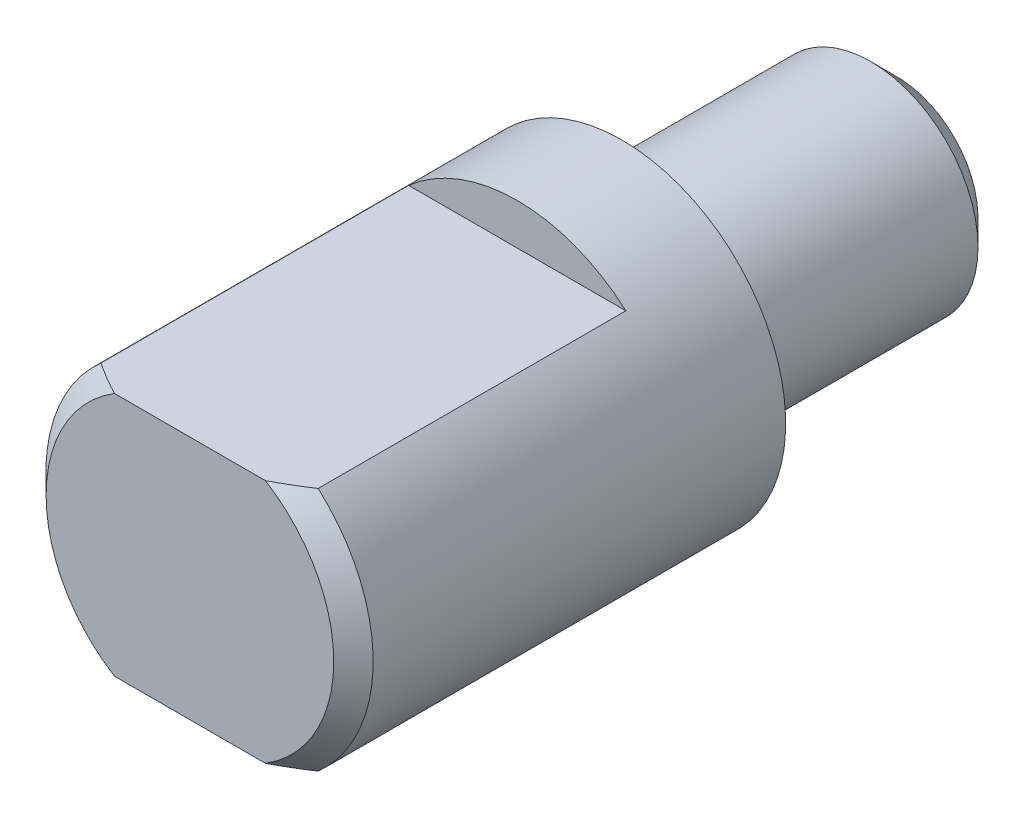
ISO-10303-21;
HEADER;
FILE_DESCRIPTION(('STEP AP214'),'2;1');
FILE_NAME('part.step','',(''),(''),'','','');
FILE_SCHEMA(('AUTOMOTIVE_DESIGN { 1 0 10303 214 1 1 1 1 }'));
ENDSEC;
DATA;
#1=APPLICATION_CONTEXT('core data for automotive mechanical design processes');
#2=APPLICATION_PROTOCOL_DEFINITION('international standard','automotive_design',2000,#1);
#3=PRODUCT_CONTEXT('',#1,'mechanical');
#4=PRODUCT('Part','Part','',(#3));
#5=PRODUCT_RELATED_PRODUCT_CATEGORY('part','',(#4));
#6=PRODUCT_DEFINITION_FORMATION('','',#4);
#7=PRODUCT_DEFINITION_CONTEXT('part definition',#1,'design');
#8=PRODUCT_DEFINITION('design','',#6,#7);
#9=PRODUCT_DEFINITION_SHAPE('','',#8);
#10=(LENGTH_UNIT() NAMED_UNIT(*) SI_UNIT(.MILLI.,.METRE.));
#11=(NAMED_UNIT(*) PLANE_ANGLE_UNIT() SI_UNIT($,.RADIAN.));
#12=(NAMED_UNIT(*) SI_UNIT($,.STERADIAN.) SOLID_ANGLE_UNIT());
#13=UNCERTAINTY_MEASURE_WITH_UNIT(LENGTH_MEASURE(1.E-05),#10,'distance_accuracy_value','');
#14=(GEOMETRIC_REPRESENTATION_CONTEXT(3) GLOBAL_UNCERTAINTY_ASSIGNED_CONTEXT((#13)) GLOBAL_UNIT_ASSIGNED_CONTEXT((#10,
#11,#12)) REPRESENTATION_CONTEXT('',''));
#15=CARTESIAN_POINT('',(0.,0.,0.));
#16=DIRECTION('',(0.,0.,1.));
#17=DIRECTION('',(1.,0.,0.));
#18=AXIS2_PLACEMENT_3D('',#15,#16,#17);
#19=CARTESIAN_POINT('',(0.,0.,3.684));
#20=DIRECTION('',(0.,0.,-1.));
#21=DIRECTION('',(0.,1.,0.));
#22=AXIS2_PLACEMENT_3D('',#19,#20,#21);
#23=CONICAL_SURFACE('',#22,3.175,0.79193401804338);
#24=CARTESIAN_POINT('',(0.,0.,3.684));
#25=DIRECTION('',(0.,0.,1.));
#26=DIRECTION('',(0.,-1.,0.));
#27=AXIS2_PLACEMENT_3D('',#24,#25,#26);
#28=CIRCLE('',#27,3.175);
#29=CARTESIAN_POINT('',(-2.10713075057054,2.375,3.684));
#30=VERTEX_POINT('',#29);
#31=CARTESIAN_POINT('',(-2.10713075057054,-2.375,3.684));
#32=VERTEX_POINT('',#31);
#33=EDGE_CURVE('E104',#30,#32,#28,.T.);
#34=ORIENTED_EDGE('',*,*,#33,.T.);
#35=CARTESIAN_POINT('',(-6.62966945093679,-2.375,-0.133015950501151));
#36=CARTESIAN_POINT('',(-6.41872085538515,-2.375,0.0629362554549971));
#37=CARTESIAN_POINT('',(-6.20729327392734,-2.375,0.258380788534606));
#38=CARTESIAN_POINT('',(-5.78286017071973,-2.375,0.647887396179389));
#39=CARTESIAN_POINT('',(-5.56985352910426,-2.375,0.841948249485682));
#40=CARTESIAN_POINT('',(-5.13574053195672,-2.375,1.23363349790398));
#41=CARTESIAN_POINT('',(-4.9145790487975,-2.375,1.43119690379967));
#42=CARTESIAN_POINT('',(-4.46963283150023,-2.375,1.82304516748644));
#43=CARTESIAN_POINT('',(-4.24585006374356,-2.375,2.01733224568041));
#44=CARTESIAN_POINT('',(-3.90719638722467,-2.375,2.30510248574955));
#45=CARTESIAN_POINT('',(-3.79385459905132,-2.375,2.40038380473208));
#46=CARTESIAN_POINT('',(-3.56590809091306,-2.375,2.58942155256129));
#47=CARTESIAN_POINT('',(-3.4513034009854,-2.375,2.68317801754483));
#48=CARTESIAN_POINT('',(-3.22025369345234,-2.375,2.86895465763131));
#49=CARTESIAN_POINT('',(-3.10380502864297,-2.375,2.96097030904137));
#50=CARTESIAN_POINT('',(-2.8689222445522,-2.375,3.14241965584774));
#51=CARTESIAN_POINT('',(-2.75048831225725,-2.375,3.23185359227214));
#52=CARTESIAN_POINT('',(-2.51255729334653,-2.375,3.40617108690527));
#53=CARTESIAN_POINT('',(-2.3930916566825,-2.375,3.49109735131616));
#54=CARTESIAN_POINT('',(-2.1509050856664,-2.375,3.65634247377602));
#55=CARTESIAN_POINT('',(-2.02818269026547,-2.375,3.73665921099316));
#56=CARTESIAN_POINT('',(-1.77912466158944,-2.375,3.89039659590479));
#57=CARTESIAN_POINT('',(-1.65280524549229,-2.375,3.96384327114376));
#58=CARTESIAN_POINT('',(-1.39512518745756,-2.375,4.10119391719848));
#59=CARTESIAN_POINT('',(-1.26377071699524,-2.375,4.16510912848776));
#60=CARTESIAN_POINT('',(-1.05701971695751,-2.375,4.25273595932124));
#61=CARTESIAN_POINT('',(-0.983728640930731,-2.375,4.28140199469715));
#62=CARTESIAN_POINT('',(-0.835356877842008,-2.375,4.33377721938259));
#63=CARTESIAN_POINT('',(-0.760275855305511,-2.375,4.35748547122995));
#64=CARTESIAN_POINT('',(-0.608898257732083,-2.375,4.39885359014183));
#65=CARTESIAN_POINT('',(-0.532610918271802,-2.375,4.41654679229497));
#66=CARTESIAN_POINT('',(-0.378780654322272,-2.375,4.445154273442));
#67=CARTESIAN_POINT('',(-0.301238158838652,-2.375,4.45607082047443));
#68=CARTESIAN_POINT('',(-0.144559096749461,-2.375,4.47054748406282));
#69=CARTESIAN_POINT('',(-0.0654144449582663,-2.375,4.47402190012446));
#70=CARTESIAN_POINT('',(0.0928249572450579,-2.375,4.47312081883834));
#71=CARTESIAN_POINT('',(0.171919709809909,-2.375,4.4687456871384));
#72=CARTESIAN_POINT('',(0.329626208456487,-2.375,4.45241265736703));
#73=CARTESIAN_POINT('',(0.40823478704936,-2.375,4.44042470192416));
#74=CARTESIAN_POINT('',(0.564086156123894,-2.375,4.40957980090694));
#75=CARTESIAN_POINT('',(0.641328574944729,-2.375,4.39072101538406));
#76=CARTESIAN_POINT('',(0.827865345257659,-2.375,4.33746225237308));
#77=CARTESIAN_POINT('',(0.936246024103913,-2.375,4.29987709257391));
#78=CARTESIAN_POINT('',(1.14927492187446,-2.375,4.21535984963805));
#79=CARTESIAN_POINT('',(1.25392057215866,-2.375,4.16842147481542));
#80=CARTESIAN_POINT('',(1.46087103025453,-2.375,4.06709514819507));
#81=CARTESIAN_POINT('',(1.56313950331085,-2.375,4.01263383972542));
#82=CARTESIAN_POINT('',(1.71427099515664,-2.375,3.9270384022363));
#83=CARTESIAN_POINT('',(1.76426245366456,-2.375,3.89786057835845));
#84=CARTESIAN_POINT('',(1.86356372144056,-2.375,3.83837009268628));
#85=CARTESIAN_POINT('',(1.91287355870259,-2.375,3.80805747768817));
#86=CARTESIAN_POINT('',(2.07522042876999,-2.375,3.70601224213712));
#87=CARTESIAN_POINT('',(2.18692206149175,-2.375,3.63215349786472));
#88=CARTESIAN_POINT('',(2.40772318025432,-2.375,3.48062951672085));
#89=CARTESIAN_POINT('',(2.5168220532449,-2.375,3.4029633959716));
#90=CARTESIAN_POINT('',(2.73301390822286,-2.375,3.24473477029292));
#91=CARTESIAN_POINT('',(2.84010537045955,-2.375,3.16417019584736));
#92=CARTESIAN_POINT('',(3.05261723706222,-2.375,3.00086187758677));
#93=CARTESIAN_POINT('',(3.15803753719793,-2.375,2.9181179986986));
#94=CARTESIAN_POINT('',(3.47300086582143,-2.375,2.6667998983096));
#95=CARTESIAN_POINT('',(3.68051445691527,-2.375,2.49568568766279));
#96=CARTESIAN_POINT('',(4.09182405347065,-2.375,2.14926116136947));
#97=CARTESIAN_POINT('',(4.29562161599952,-2.375,1.97395267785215));
#98=CARTESIAN_POINT('',(4.6793123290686,-2.375,1.63905531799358));
#99=CARTESIAN_POINT('',(4.85946034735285,-2.375,1.47975783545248));
#100=CARTESIAN_POINT('',(5.2182458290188,-2.375,1.15942835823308));
#101=CARTESIAN_POINT('',(5.39688309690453,-2.375,0.998396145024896));
#102=CARTESIAN_POINT('',(5.75173692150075,-2.375,0.67617475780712));
#103=CARTESIAN_POINT('',(5.92796166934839,-2.375,0.514994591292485));
#104=CARTESIAN_POINT('',(6.27946145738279,-2.375,0.191659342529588));
#105=CARTESIAN_POINT('',(6.45473664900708,-2.375,0.0295044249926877));
#106=CARTESIAN_POINT('',(6.62966945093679,-2.375,-0.133015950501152));
#107=B_SPLINE_CURVE_WITH_KNOTS('',3,(#35,#36,#37,#38,#39,#40,#41,#42,#43,#44,#45,#46,#47,#48,
#49,#50,#51,#52,#53,#54,#55,#56,#57,#58,#59,#60,#61,#62,#63,#64,#65,#66,#67,#68,#69,#70,#71,#72,
#73,#74,#75,#76,#77,#78,#79,#80,#81,#82,#83,#84,#85,#86,#87,#88,#89,#90,#91,#92,#93,#94,#95,#96,
#97,#98,#99,#100,#101,#102,#103,#104,#105,#106),.UNSPECIFIED.,.F.,.F.,(4,2,2,2,2,2,2,2,2,2,2,2,
2,2,2,2,2,2,2,2,2,2,2,2,2,2,2,2,2,2,2,2,2,2,2,4),(0.,0.863760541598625,1.72820709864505,
2.61784876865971,3.50686109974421,3.95106286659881,4.39525409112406,4.84047397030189,
5.28565214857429,5.72530383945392,6.16515621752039,6.60326828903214,7.04085953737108,
7.27681206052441,7.5128091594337,7.74747620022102,7.98206465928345,8.21934033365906,
8.45660495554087,8.69481223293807,8.93308334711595,9.27660606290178,9.6203606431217,
9.9677411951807,10.141380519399,10.3150126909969,10.7166254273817,11.1183318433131,
11.5203310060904,11.9223551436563,12.7291420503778,13.5355827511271,14.2569976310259,
14.9785044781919,15.6949553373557,16.4112883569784),.UNSPECIFIED.);
#108=CARTESIAN_POINT('',(-1.46406113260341,-2.375,4.064));
#109=VERTEX_POINT('',#108);
#110=EDGE_CURVE('E127',#32,#109,#107,.T.);
#111=ORIENTED_EDGE('',*,*,#110,.T.);
#112=CARTESIAN_POINT('',(0.,0.,4.064));
#113=DIRECTION('',(0.,0.,1.));
#114=DIRECTION('',(0.,-1.,0.));
#115=AXIS2_PLACEMENT_3D('',#112,#113,#114);
#116=CIRCLE('',#115,2.79);
#117=CARTESIAN_POINT('',(-1.46406113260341,2.375,4.064));
#118=VERTEX_POINT('',#117);
#119=EDGE_CURVE('E114',#118,#109,#116,.T.);
#120=ORIENTED_EDGE('',*,*,#119,.F.);
#121=CARTESIAN_POINT('',(6.62966945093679,2.375,-0.133015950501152));
#122=CARTESIAN_POINT('',(6.41872085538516,2.375,0.0629362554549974));
#123=CARTESIAN_POINT('',(6.20729327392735,2.375,0.258380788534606));
#124=CARTESIAN_POINT('',(5.78286017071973,2.375,0.647887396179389));
#125=CARTESIAN_POINT('',(5.56985352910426,2.375,0.841948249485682));
#126=CARTESIAN_POINT('',(5.13574053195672,2.375,1.23363349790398));
#127=CARTESIAN_POINT('',(4.9145790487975,2.375,1.43119690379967));
#128=CARTESIAN_POINT('',(4.46963283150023,2.375,1.82304516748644));
#129=CARTESIAN_POINT('',(4.24585006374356,2.375,2.01733224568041));
#130=CARTESIAN_POINT('',(3.90719638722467,2.375,2.30510248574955));
#131=CARTESIAN_POINT('',(3.79385459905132,2.375,2.40038380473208));
#132=CARTESIAN_POINT('',(3.56590809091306,2.375,2.5894215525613));
#133=CARTESIAN_POINT('',(3.4513034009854,2.375,2.68317801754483));
#134=CARTESIAN_POINT('',(3.22025369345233,2.375,2.86895465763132));
#135=CARTESIAN_POINT('',(3.10380502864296,2.375,2.96097030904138));
#136=CARTESIAN_POINT('',(2.8689222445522,2.375,3.14241965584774));
#137=CARTESIAN_POINT('',(2.75048831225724,2.375,3.23185359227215));
#138=CARTESIAN_POINT('',(2.51255729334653,2.375,3.40617108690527));
#139=CARTESIAN_POINT('',(2.3930916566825,2.375,3.49109735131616));
#140=CARTESIAN_POINT('',(2.1509050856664,2.375,3.65634247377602));
#141=CARTESIAN_POINT('',(2.02818269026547,2.375,3.73665921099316));
#142=CARTESIAN_POINT('',(1.77912466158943,2.375,3.89039659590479));
#143=CARTESIAN_POINT('',(1.65280524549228,2.375,3.96384327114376));
#144=CARTESIAN_POINT('',(1.39512518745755,2.375,4.10119391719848));
#145=CARTESIAN_POINT('',(1.26377071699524,2.375,4.16510912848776));
#146=CARTESIAN_POINT('',(1.05701971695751,2.375,4.25273595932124));
#147=CARTESIAN_POINT('',(0.983728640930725,2.375,4.28140199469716));
#148=CARTESIAN_POINT('',(0.835356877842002,2.375,4.3337772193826));
#149=CARTESIAN_POINT('',(0.760275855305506,2.375,4.35748547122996));
#150=CARTESIAN_POINT('',(0.608898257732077,2.375,4.39885359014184));
#151=CARTESIAN_POINT('',(0.532610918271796,2.375,4.41654679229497));
#152=CARTESIAN_POINT('',(0.378780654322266,2.375,4.445154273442));
#153=CARTESIAN_POINT('',(0.301238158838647,2.375,4.45607082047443));
#154=CARTESIAN_POINT('',(0.144559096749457,2.375,4.47054748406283));
#155=CARTESIAN_POINT('',(0.0654144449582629,2.375,4.47402190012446));
#156=CARTESIAN_POINT('',(-0.0928249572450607,2.375,4.47312081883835));
#157=CARTESIAN_POINT('',(-0.171919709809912,2.375,4.4687456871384));
#158=CARTESIAN_POINT('',(-0.32962620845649,2.375,4.45241265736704));
#159=CARTESIAN_POINT('',(-0.408234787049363,2.375,4.44042470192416));
#160=CARTESIAN_POINT('',(-0.564086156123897,2.375,4.40957980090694));
#161=CARTESIAN_POINT('',(-0.641328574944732,2.375,4.39072101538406));
#162=CARTESIAN_POINT('',(-0.827865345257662,2.375,4.33746225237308));
#163=CARTESIAN_POINT('',(-0.936246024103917,2.375,4.29987709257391));
#164=CARTESIAN_POINT('',(-1.14927492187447,2.375,4.21535984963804));
#165=CARTESIAN_POINT('',(-1.25392057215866,2.375,4.16842147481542));
#166=CARTESIAN_POINT('',(-1.46087103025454,2.375,4.06709514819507));
#167=CARTESIAN_POINT('',(-1.56313950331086,2.375,4.01263383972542));
#168=CARTESIAN_POINT('',(-1.71427099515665,2.375,3.9270384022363));
#169=CARTESIAN_POINT('',(-1.76426245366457,2.375,3.89786057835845));
#170=CARTESIAN_POINT('',(-1.86356372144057,2.375,3.83837009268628));
#171=CARTESIAN_POINT('',(-1.91287355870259,2.375,3.80805747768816));
#172=CARTESIAN_POINT('',(-2.07522042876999,2.375,3.70601224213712));
#173=CARTESIAN_POINT('',(-2.18692206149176,2.375,3.63215349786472));
#174=CARTESIAN_POINT('',(-2.40772318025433,2.375,3.48062951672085));
#175=CARTESIAN_POINT('',(-2.51682205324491,2.375,3.4029633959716));
#176=CARTESIAN_POINT('',(-2.73301390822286,2.375,3.24473477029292));
#177=CARTESIAN_POINT('',(-2.84010537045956,2.375,3.16417019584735));
#178=CARTESIAN_POINT('',(-3.05261723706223,2.375,3.00086187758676));
#179=CARTESIAN_POINT('',(-3.15803753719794,2.375,2.91811799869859));
#180=CARTESIAN_POINT('',(-3.47300086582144,2.375,2.6667998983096));
#181=CARTESIAN_POINT('',(-3.68051445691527,2.375,2.49568568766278));
#182=CARTESIAN_POINT('',(-4.09182405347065,2.375,2.14926116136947));
#183=CARTESIAN_POINT('',(-4.29562161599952,2.375,1.97395267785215));
#184=CARTESIAN_POINT('',(-4.6793123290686,2.375,1.63905531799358));
#185=CARTESIAN_POINT('',(-4.85946034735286,2.375,1.47975783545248));
#186=CARTESIAN_POINT('',(-5.2182458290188,2.375,1.15942835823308));
#187=CARTESIAN_POINT('',(-5.39688309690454,2.375,0.998396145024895));
#188=CARTESIAN_POINT('',(-5.75173692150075,2.375,0.67617475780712));
#189=CARTESIAN_POINT('',(-5.92796166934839,2.375,0.514994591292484));
#190=CARTESIAN_POINT('',(-6.27946145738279,2.375,0.191659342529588));
#191=CARTESIAN_POINT('',(-6.45473664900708,2.375,0.0295044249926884));
#192=CARTESIAN_POINT('',(-6.62966945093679,2.375,-0.133015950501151));
#193=B_SPLINE_CURVE_WITH_KNOTS('',3,(#121,#122,#123,#124,#125,#126,#127,#128,#129,#130,#131,
#132,#133,#134,#135,#136,#137,#138,#139,#140,#141,#142,#143,#144,#145,#146,#147,#148,#149,#150,
#151,#152,#153,#154,#155,#156,#157,#158,#159,#160,#161,#162,#163,#164,#165,#166,#167,#168,#169,
#170,#171,#172,#173,#174,#175,#176,#177,#178,#179,#180,#181,#182,#183,#184,#185,#186,#187,#188,
#189,#190,#191,#192),.UNSPECIFIED.,.F.,.F.,(4,2,2,2,2,2,2,2,2,2,2,2,2,2,2,2,2,2,2,2,2,2,2,2,2,2,
2,2,2,2,2,2,2,2,2,4),(0.,0.863760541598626,1.72820709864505,2.61784876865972,3.50686109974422,
3.95106286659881,4.39525409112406,4.84047397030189,5.2856521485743,5.72530383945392,
6.1651562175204,6.60326828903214,7.04085953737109,7.27681206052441,7.51280915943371,
7.74747620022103,7.98206465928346,8.21934033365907,8.45660495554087,8.69481223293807,
8.93308334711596,9.27660606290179,9.62036064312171,9.96774119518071,10.141380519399,
10.3150126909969,10.7166254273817,11.1183318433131,11.5203310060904,11.9223551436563,
12.7291420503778,13.5355827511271,14.2569976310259,14.9785044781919,15.6949553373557,
16.4112883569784),.UNSPECIFIED.);
#194=EDGE_CURVE('E128',#118,#30,#193,.T.);
#195=ORIENTED_EDGE('',*,*,#194,.T.);
#196=EDGE_LOOP('',(#34,#111,#120,#195));
#197=FACE_BOUND('',#196,.T.);
#198=ADVANCED_FACE('F32',(#197),#23,.T.);
#199=CARTESIAN_POINT('',(0.,0.,4.064));
#200=DIRECTION('',(0.,0.,-1.));
#201=DIRECTION('',(0.,1.,0.));
#202=AXIS2_PLACEMENT_3D('',#199,#200,#201);
#203=PLANE('',#202);
#204=ORIENTED_EDGE('',*,*,#119,.T.);
#205=DIRECTION('',(1.,0.,0.));
#206=VECTOR('',#205,1.);
#207=CARTESIAN_POINT('',(-5.,-2.375,4.064));
#208=LINE('',#207,#206);
#209=CARTESIAN_POINT('',(1.46406113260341,-2.375,4.064));
#210=VERTEX_POINT('',#209);
#211=EDGE_CURVE('E94',#109,#210,#208,.T.);
#212=ORIENTED_EDGE('',*,*,#211,.T.);
#213=CARTESIAN_POINT('',(1.46406113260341,2.375,4.064));
#214=VERTEX_POINT('',#213);
#215=EDGE_CURVE('E108',#210,#214,#116,.T.);
#216=ORIENTED_EDGE('',*,*,#215,.T.);
#217=DIRECTION('',(1.,0.,0.));
#218=VECTOR('',#217,1.);
#219=CARTESIAN_POINT('',(-5.,2.375,4.064));
#220=LINE('',#219,#218);
#221=EDGE_CURVE('E134',#118,#214,#220,.T.);
#222=ORIENTED_EDGE('',*,*,#221,.F.);
#223=EDGE_LOOP('',(#204,#212,#216,#222));
#224=FACE_BOUND('',#223,.T.);
#225=ADVANCED_FACE('F34',(#224),#203,.F.);
#226=ORIENTED_EDGE('',*,*,#215,.F.);
#227=CARTESIAN_POINT('',(2.10713075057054,-2.375,3.684));
#228=VERTEX_POINT('',#227);
#229=EDGE_CURVE('E93',#210,#228,#107,.T.);
#230=ORIENTED_EDGE('',*,*,#229,.T.);
#231=CARTESIAN_POINT('',(2.10713075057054,2.375,3.684));
#232=VERTEX_POINT('',#231);
#233=EDGE_CURVE('E100',#228,#232,#28,.T.);
#234=ORIENTED_EDGE('',*,*,#233,.T.);
#235=EDGE_CURVE('E131',#232,#214,#193,.T.);
#236=ORIENTED_EDGE('',*,*,#235,.T.);
#237=EDGE_LOOP('',(#226,#230,#234,#236));
#238=FACE_BOUND('',#237,.T.);
#239=ADVANCED_FACE('F143',(#238),#23,.T.);
#240=CARTESIAN_POINT('',(0.,0.,4.064));
#241=DIRECTION('',(0.,0.,1.));
#242=DIRECTION('',(0.,-1.,0.));
#243=AXIS2_PLACEMENT_3D('',#240,#241,#242);
#244=CYLINDRICAL_SURFACE('',#243,3.175);
#245=ORIENTED_EDGE('',*,*,#233,.F.);
#246=DIRECTION('',(0.,0.,1.));
#247=VECTOR('',#246,1.);
#248=CARTESIAN_POINT('',(2.10713075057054,-2.375,4.064));
#249=LINE('',#248,#247);
#250=CARTESIAN_POINT('',(2.10713075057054,-2.375,-2.286));
#251=VERTEX_POINT('',#250);
#252=EDGE_CURVE('E11',#228,#251,#249,.F.);
#253=ORIENTED_EDGE('',*,*,#252,.T.);
#254=CARTESIAN_POINT('',(0.,0.,-2.286));
#255=DIRECTION('',(0.,0.,-1.));
#256=DIRECTION('',(-1.,0.,0.));
#257=AXIS2_PLACEMENT_3D('',#254,#255,#256);
#258=CIRCLE('',#257,3.175);
#259=CARTESIAN_POINT('',(-2.10713075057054,-2.375,-2.286));
#260=VERTEX_POINT('',#259);
#261=EDGE_CURVE('E84',#251,#260,#258,.T.);
#262=ORIENTED_EDGE('',*,*,#261,.T.);
#263=DIRECTION('',(0.,0.,1.));
#264=VECTOR('',#263,1.);
#265=CARTESIAN_POINT('',(-2.10713075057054,-2.375,4.064));
#266=LINE('',#265,#264);
#267=EDGE_CURVE('E40',#260,#32,#266,.T.);
#268=ORIENTED_EDGE('',*,*,#267,.T.);
#269=ORIENTED_EDGE('',*,*,#33,.F.);
#270=DIRECTION('',(0.,0.,1.));
#271=VECTOR('',#270,1.);
#272=CARTESIAN_POINT('',(-2.10713075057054,2.375,4.064));
#273=LINE('',#272,#271);
#274=CARTESIAN_POINT('',(-2.10713075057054,2.375,-2.286));
#275=VERTEX_POINT('',#274);
#276=EDGE_CURVE('E117',#30,#275,#273,.F.);
#277=ORIENTED_EDGE('',*,*,#276,.T.);
#278=CARTESIAN_POINT('',(0.,0.,-2.286));
#279=DIRECTION('',(0.,0.,-1.));
#280=DIRECTION('',(-1.,0.,0.));
#281=AXIS2_PLACEMENT_3D('',#278,#279,#280);
#282=CIRCLE('',#281,3.175);
#283=CARTESIAN_POINT('',(2.10713075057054,2.375,-2.286));
#284=VERTEX_POINT('',#283);
#285=EDGE_CURVE('E120',#275,#284,#282,.T.);
#286=ORIENTED_EDGE('',*,*,#285,.T.);
#287=DIRECTION('',(0.,0.,1.));
#288=VECTOR('',#287,1.);
#289=CARTESIAN_POINT('',(2.10713075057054,2.375,4.064));
#290=LINE('',#289,#288);
#291=EDGE_CURVE('E88',#284,#232,#290,.T.);
#292=ORIENTED_EDGE('',*,*,#291,.T.);
#293=EDGE_LOOP('',(#245,#253,#262,#268,#269,#277,#286,#292));
#294=FACE_BOUND('',#293,.T.);
#295=CARTESIAN_POINT('',(0.,0.,-4.318));
#296=DIRECTION('',(0.,0.,1.));
#297=DIRECTION('',(0.,-1.,0.));
#298=AXIS2_PLACEMENT_3D('',#295,#296,#297);
#299=CIRCLE('',#298,3.175);
#300=CARTESIAN_POINT('',(0.,-3.175,-4.318));
#301=VERTEX_POINT('',#300);
#302=EDGE_CURVE('E105',#301,#301,#299,.T.);
#303=ORIENTED_EDGE('',*,*,#302,.T.);
#304=EDGE_LOOP('',(#303));
#305=FACE_BOUND('',#304,.T.);
#306=ADVANCED_FACE('F97',(#294,#305),#244,.T.);
#307=CARTESIAN_POINT('',(0.,2.08280000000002,-4.318));
#308=DIRECTION('',(0.,0.,1.));
#309=DIRECTION('',(0.,-1.,0.));
#310=AXIS2_PLACEMENT_3D('',#307,#308,#309);
#311=PLANE('',#310);
#312=ORIENTED_EDGE('',*,*,#302,.F.);
#313=EDGE_LOOP('',(#312));
#314=FACE_BOUND('',#313,.T.);
#315=CARTESIAN_POINT('',(0.,0.,-4.318));
#316=DIRECTION('',(0.,0.,1.));
#317=DIRECTION('',(0.,-1.,0.));
#318=AXIS2_PLACEMENT_3D('',#315,#316,#317);
#319=CIRCLE('',#318,2.08280000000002);
#320=CARTESIAN_POINT('',(0.,-2.08280000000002,-4.318));
#321=VERTEX_POINT('',#320);
#322=EDGE_CURVE('E110',#321,#321,#319,.T.);
#323=ORIENTED_EDGE('',*,*,#322,.T.);
#324=EDGE_LOOP('',(#323));
#325=FACE_BOUND('',#324,.T.);
#326=ADVANCED_FACE('F164',(#314,#325),#311,.F.);
#327=CARTESIAN_POINT('',(0.,0.,4.064));
#328=DIRECTION('',(0.,0.,1.));
#329=DIRECTION('',(0.,-1.,0.));
#330=AXIS2_PLACEMENT_3D('',#327,#328,#329);
#331=CYLINDRICAL_SURFACE('',#330,2.08280000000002);
#332=ORIENTED_EDGE('',*,*,#322,.F.);
#333=EDGE_LOOP('',(#332));
#334=FACE_BOUND('',#333,.T.);
#335=CARTESIAN_POINT('',(0.,0.,-9.142));
#336=DIRECTION('',(0.,0.,1.));
#337=DIRECTION('',(0.,-1.,0.));
#338=AXIS2_PLACEMENT_3D('',#335,#336,#337);
#339=CIRCLE('',#338,2.08280000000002);
#340=CARTESIAN_POINT('',(0.,-2.08280000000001,-9.142));
#341=VERTEX_POINT('',#340);
#342=EDGE_CURVE('E262',#341,#341,#339,.T.);
#343=ORIENTED_EDGE('',*,*,#342,.T.);
#344=EDGE_LOOP('',(#343));
#345=FACE_BOUND('',#344,.T.);
#346=ADVANCED_FACE('F160',(#334,#345),#331,.T.);
#347=CARTESIAN_POINT('',(0.,0.,-9.652));
#348=DIRECTION('',(0.,0.,1.));
#349=DIRECTION('',(0.,-1.,0.));
#350=AXIS2_PLACEMENT_3D('',#347,#348,#349);
#351=CONICAL_SURFACE('',#350,1.57,0.788135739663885);
#352=ORIENTED_EDGE('',*,*,#342,.F.);
#353=EDGE_LOOP('',(#352));
#354=FACE_BOUND('',#353,.T.);
#355=CARTESIAN_POINT('',(0.,0.,-9.652));
#356=DIRECTION('',(0.,0.,1.));
#357=DIRECTION('',(0.,-1.,0.));
#358=AXIS2_PLACEMENT_3D('',#355,#356,#357);
#359=CIRCLE('',#358,1.57);
#360=CARTESIAN_POINT('',(0.,-1.57,-9.652));
#361=VERTEX_POINT('',#360);
#362=EDGE_CURVE('E133',#361,#361,#359,.T.);
#363=ORIENTED_EDGE('',*,*,#362,.T.);
#364=EDGE_LOOP('',(#363));
#365=FACE_BOUND('',#364,.T.);
#366=ADVANCED_FACE('F156',(#354,#365),#351,.T.);
#367=CARTESIAN_POINT('',(0.,0.,-9.652));
#368=DIRECTION('',(0.,0.,1.));
#369=DIRECTION('',(0.,-1.,0.));
#370=AXIS2_PLACEMENT_3D('',#367,#368,#369);
#371=PLANE('',#370);
#372=ORIENTED_EDGE('',*,*,#362,.F.);
#373=EDGE_LOOP('',(#372));
#374=FACE_BOUND('',#373,.T.);
#375=ADVANCED_FACE('F153',(#374),#371,.F.);
#376=CARTESIAN_POINT('',(-5.,2.375,-2.286));
#377=DIRECTION('',(0.,0.,-1.));
#378=DIRECTION('',(-1.,0.,0.));
#379=AXIS2_PLACEMENT_3D('',#376,#377,#378);
#380=PLANE('',#379);
#381=DIRECTION('',(1.,0.,0.));
#382=VECTOR('',#381,1.);
#383=CARTESIAN_POINT('',(-5.,2.375,-2.286));
#384=LINE('',#383,#382);
#385=EDGE_CURVE('E54',#275,#284,#384,.T.);
#386=ORIENTED_EDGE('',*,*,#385,.T.);
#387=ORIENTED_EDGE('',*,*,#285,.F.);
#388=EDGE_LOOP('',(#386,#387));
#389=FACE_BOUND('',#388,.T.);
#390=ADVANCED_FACE('F151',(#389),#380,.F.);
#391=CARTESIAN_POINT('',(-5.,2.375,4.064));
#392=DIRECTION('',(0.,-1.,0.));
#393=DIRECTION('',(0.,0.,-1.));
#394=AXIS2_PLACEMENT_3D('',#391,#392,#393);
#395=PLANE('',#394);
#396=ORIENTED_EDGE('',*,*,#291,.F.);
#397=ORIENTED_EDGE('',*,*,#385,.F.);
#398=ORIENTED_EDGE('',*,*,#276,.F.);
#399=ORIENTED_EDGE('',*,*,#194,.F.);
#400=ORIENTED_EDGE('',*,*,#221,.T.);
#401=ORIENTED_EDGE('',*,*,#235,.F.);
#402=EDGE_LOOP('',(#396,#397,#398,#399,#400,#401));
#403=FACE_BOUND('',#402,.T.);
#404=ADVANCED_FACE('F146',(#403),#395,.F.);
#405=CARTESIAN_POINT('',(-5.,-2.375,4.064));
#406=DIRECTION('',(0.,1.,0.));
#407=DIRECTION('',(0.,0.,1.));
#408=AXIS2_PLACEMENT_3D('',#405,#406,#407);
#409=PLANE('',#408);
#410=ORIENTED_EDGE('',*,*,#267,.F.);
#411=DIRECTION('',(1.,0.,0.));
#412=VECTOR('',#411,1.);
#413=CARTESIAN_POINT('',(-5.,-2.375,-2.286));
#414=LINE('',#413,#412);
#415=EDGE_CURVE('E46',#260,#251,#414,.T.);
#416=ORIENTED_EDGE('',*,*,#415,.T.);
#417=ORIENTED_EDGE('',*,*,#252,.F.);
#418=ORIENTED_EDGE('',*,*,#229,.F.);
#419=ORIENTED_EDGE('',*,*,#211,.F.);
#420=ORIENTED_EDGE('',*,*,#110,.F.);
#421=EDGE_LOOP('',(#410,#416,#417,#418,#419,#420));
#422=FACE_BOUND('',#421,.T.);
#423=ADVANCED_FACE('F91',(#422),#409,.F.);
#424=CARTESIAN_POINT('',(-5.,-2.375,-2.286));
#425=DIRECTION('',(0.,0.,-1.));
#426=DIRECTION('',(-1.,0.,0.));
#427=AXIS2_PLACEMENT_3D('',#424,#425,#426);
#428=PLANE('',#427);
#429=ORIENTED_EDGE('',*,*,#415,.F.);
#430=ORIENTED_EDGE('',*,*,#261,.F.);
#431=EDGE_LOOP('',(#429,#430));
#432=FACE_BOUND('',#431,.T.);
#433=ADVANCED_FACE('F85',(#432),#428,.F.);
#434=CLOSED_SHELL('',(#198,#225,#239,#306,#326,#346,#366,#375,#390,#404,#423,#433));
#435=MANIFOLD_SOLID_BREP('B2',#434);
#436=ADVANCED_BREP_SHAPE_REPRESENTATION('',(#18,#435),#14);
#437=SHAPE_DEFINITION_REPRESENTATION(#9,#436);
ENDSEC;
END-ISO-10303-21;
